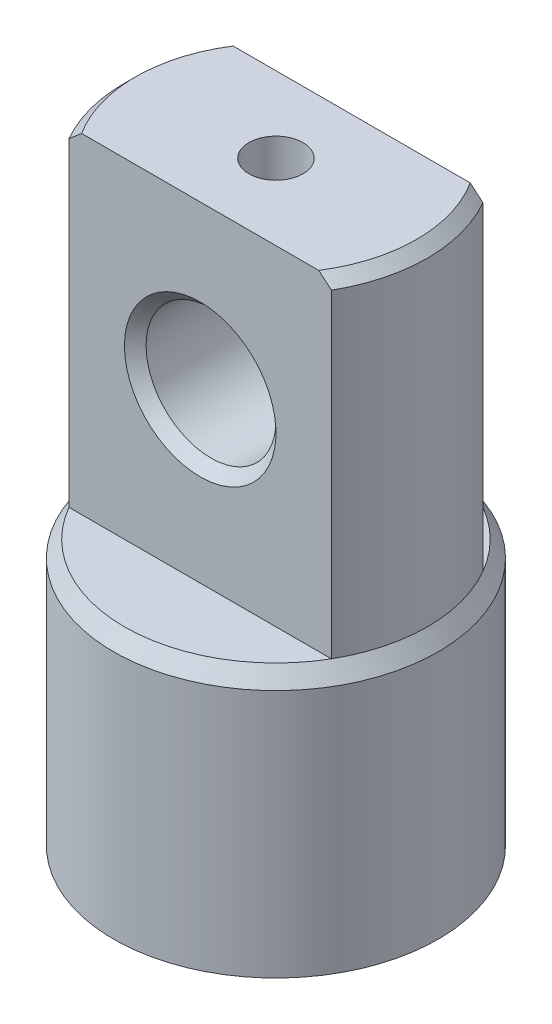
from build123d import *

# Parameters (mm, degrees)
CUT_EXTRUDE3_DEPTH         = 30.5
CHAMFER1_SIZE              = 1
F_12_0_12_DIAMETER_HOLE1_D = 12
CHAMFER2_SIZE              = 1
M6_TAPPED_HOLE1_REACH      = 60.949
M6_TAPPED_HOLE1_BORE_R     = 2.5


with BuildPart() as part:
    # Sketch1 → Revolve1 (revolve)
    with BuildSketch(Plane.XY, mode=Mode.PRIVATE) as revolve1_sk:
        Polygon((0, 0), (15, 0), (15, 23), (14, 24.5), (14, 55), (0, 55), align=None)
    revolve(revolve1_sk.sketch.rotate(Axis((0, 0, 0), (0, 1, 0)), 90), axis=Axis((0, 0, 0), (0, 1, 0)))

    # Sketch3 → Cut-Extrude3 (cut)
    with BuildSketch(Plane(origin=(0, 55, 0), x_dir=(-1, 0, 0), z_dir=(0, 1, 0))):
        with BuildLine():
            Line((13.266499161, -7), (-13.266499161, -7))
            ThreePointArc((-13.266499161, -7), (0, -15), (13.266499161, -7))
        make_face()
        with BuildLine():
            Line((13.266499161, 7), (-13.266499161, 7))
            ThreePointArc((-13.266499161, 7), (0, 15), (13.266499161, 7))
        make_face()
    extrude(amount=-CUT_EXTRUDE3_DEPTH, mode=Mode.SUBTRACT)

    # Chamfer1
    chamfer1_edges = [part.edges().sort_by_distance(p)[0] for p in [
        (-14, 55, 0),
        (14, 55, 0),
    ]]
    chamfer(chamfer1_edges, length=CHAMFER1_SIZE)

    # 12.0 _12_ Diameter Hole1 (through all)
    with Locations(Plane.XY.offset(7)):
        with Locations((0, 40)):
            Hole(F_12_0_12_DIAMETER_HOLE1_D / 2)

    # Chamfer2
    chamfer2_edges = [part.edges().sort_by_distance(p)[0] for p in [
        (6, 40, 7),
        (6, 40, -7),
    ]]
    chamfer(chamfer2_edges, length=CHAMFER2_SIZE)

    # M6 Tapped Hole1 bore → M6 Tapped Hole1 (cut, up to next)
    with BuildSketch(Plane(origin=(0, 55, 0), x_dir=(-1, 0, 0), z_dir=(0, 1, 0)), mode=Mode.PRIVATE) as m6_tapped_hole1_sk1:
        Circle(M6_TAPPED_HOLE1_BORE_R)
    m6_tapped_hole1_tool1 = extrude(m6_tapped_hole1_sk1.sketch, amount=-M6_TAPPED_HOLE1_REACH, mode=Mode.PRIVATE) & part.part
    add(m6_tapped_hole1_tool1.solids().sort_by_distance((0, 55, 0))[0], mode=Mode.SUBTRACT)


solid = part.part
